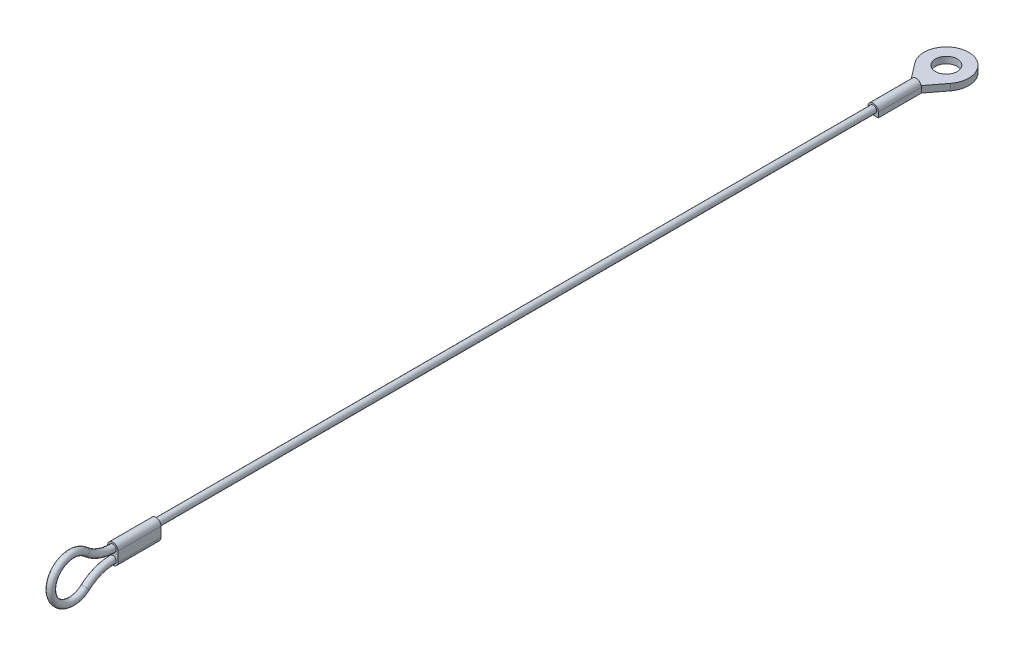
ISO-10303-21;
HEADER;
FILE_DESCRIPTION(('STEP AP214'),'2;1');
FILE_NAME('part.step','',(''),(''),'','','');
FILE_SCHEMA(('AUTOMOTIVE_DESIGN { 1 0 10303 214 1 1 1 1 }'));
ENDSEC;
DATA;
#1=APPLICATION_CONTEXT('core data for automotive mechanical design processes');
#2=APPLICATION_PROTOCOL_DEFINITION('international standard','automotive_design',2000,#1);
#3=PRODUCT_CONTEXT('',#1,'mechanical');
#4=PRODUCT('Part','Part','',(#3));
#5=PRODUCT_RELATED_PRODUCT_CATEGORY('part','',(#4));
#6=PRODUCT_DEFINITION_FORMATION('','',#4);
#7=PRODUCT_DEFINITION_CONTEXT('part definition',#1,'design');
#8=PRODUCT_DEFINITION('design','',#6,#7);
#9=PRODUCT_DEFINITION_SHAPE('','',#8);
#10=(LENGTH_UNIT() NAMED_UNIT(*) SI_UNIT(.MILLI.,.METRE.));
#11=(NAMED_UNIT(*) PLANE_ANGLE_UNIT() SI_UNIT($,.RADIAN.));
#12=(NAMED_UNIT(*) SI_UNIT($,.STERADIAN.) SOLID_ANGLE_UNIT());
#13=UNCERTAINTY_MEASURE_WITH_UNIT(LENGTH_MEASURE(1.E-05),#10,'distance_accuracy_value','');
#14=(GEOMETRIC_REPRESENTATION_CONTEXT(3) GLOBAL_UNCERTAINTY_ASSIGNED_CONTEXT((#13)) GLOBAL_UNIT_ASSIGNED_CONTEXT((#10,
#11,#12)) REPRESENTATION_CONTEXT('',''));
#15=CARTESIAN_POINT('',(0.,0.,0.));
#16=DIRECTION('',(0.,0.,1.));
#17=DIRECTION('',(1.,0.,0.));
#18=AXIS2_PLACEMENT_3D('',#15,#16,#17);
#19=CARTESIAN_POINT('',(0.,0.,-10.));
#20=DIRECTION('',(0.,0.,-1.));
#21=DIRECTION('',(-1.,0.,0.));
#22=AXIS2_PLACEMENT_3D('',#19,#20,#21);
#23=PLANE('',#22);
#24=CARTESIAN_POINT('',(0.,0.,-10.));
#25=DIRECTION('',(0.,0.,-1.));
#26=DIRECTION('',(-1.,0.,0.));
#27=AXIS2_PLACEMENT_3D('',#24,#25,#26);
#28=CIRCLE('',#27,1.195);
#29=CARTESIAN_POINT('',(-1.1499565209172,0.325,-10.));
#30=VERTEX_POINT('',#29);
#31=CARTESIAN_POINT('',(1.1499565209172,0.325,-10.));
#32=VERTEX_POINT('',#31);
#33=EDGE_CURVE('E201',#30,#32,#28,.T.);
#34=ORIENTED_EDGE('',*,*,#33,.T.);
#35=DIRECTION('',(-1.,0.,0.));
#36=VECTOR('',#35,1.);
#37=CARTESIAN_POINT('',(-1.195,0.325,-10.));
#38=LINE('',#37,#36);
#39=EDGE_CURVE('E11',#32,#30,#38,.T.);
#40=ORIENTED_EDGE('',*,*,#39,.T.);
#41=EDGE_LOOP('',(#34,#40));
#42=FACE_BOUND('',#41,.T.);
#43=ADVANCED_FACE('F39',(#42),#23,.T.);
#44=CARTESIAN_POINT('',(0.,0.,176.6));
#45=DIRECTION('',(0.,0.,-1.));
#46=DIRECTION('',(-1.,0.,0.));
#47=AXIS2_PLACEMENT_3D('',#44,#45,#46);
#48=CYLINDRICAL_SURFACE('',#47,0.795);
#49=CARTESIAN_POINT('',(0.,0.,166.6));
#50=DIRECTION('',(0.,0.,-1.));
#51=DIRECTION('',(0.,1.,0.));
#52=AXIS2_PLACEMENT_3D('',#49,#50,#51);
#53=CIRCLE('',#52,0.795);
#54=CARTESIAN_POINT('',(0.,0.795,166.6));
#55=VERTEX_POINT('',#54);
#56=EDGE_CURVE('E43',#55,#55,#53,.T.);
#57=ORIENTED_EDGE('',*,*,#56,.T.);
#58=EDGE_LOOP('',(#57));
#59=FACE_BOUND('',#58,.T.);
#60=CARTESIAN_POINT('',(0.,0.,0.));
#61=DIRECTION('',(0.,0.,1.));
#62=DIRECTION('',(1.,0.,0.));
#63=AXIS2_PLACEMENT_3D('',#60,#61,#62);
#64=CIRCLE('',#63,0.795);
#65=CARTESIAN_POINT('',(0.795,0.,0.));
#66=VERTEX_POINT('',#65);
#67=EDGE_CURVE('E236',#66,#66,#64,.T.);
#68=ORIENTED_EDGE('',*,*,#67,.T.);
#69=EDGE_LOOP('',(#68));
#70=FACE_BOUND('',#69,.T.);
#71=ADVANCED_FACE('F41',(#59,#70),#48,.T.);
#72=CARTESIAN_POINT('',(0.,2.40837442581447E-13,166.6));
#73=DIRECTION('',(0.,0.,1.));
#74=DIRECTION('',(0.,-1.,0.));
#75=AXIS2_PLACEMENT_3D('',#72,#73,#74);
#76=CYLINDRICAL_SURFACE('',#75,1.195);
#77=CARTESIAN_POINT('',(0.,2.5529347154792E-13,176.6));
#78=DIRECTION('',(0.,0.,-1.));
#79=DIRECTION('',(0.,1.,0.));
#80=AXIS2_PLACEMENT_3D('',#77,#78,#79);
#81=CIRCLE('',#80,1.195);
#82=CARTESIAN_POINT('',(-1.195,2.55439816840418E-13,176.6));
#83=VERTEX_POINT('',#82);
#84=CARTESIAN_POINT('',(1.195,2.55147126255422E-13,176.6));
#85=VERTEX_POINT('',#84);
#86=EDGE_CURVE('E248',#83,#85,#81,.T.);
#87=ORIENTED_EDGE('',*,*,#86,.T.);
#88=DIRECTION('',(0.,0.,1.));
#89=VECTOR('',#88,1.);
#90=CARTESIAN_POINT('',(1.195,2.40691097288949E-13,166.6));
#91=LINE('',#90,#89);
#92=CARTESIAN_POINT('',(1.195,2.40691097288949E-13,166.6));
#93=VERTEX_POINT('',#92);
#94=EDGE_CURVE('E268',#93,#85,#91,.T.);
#95=ORIENTED_EDGE('',*,*,#94,.F.);
#96=CARTESIAN_POINT('',(0.,2.40837442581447E-13,166.6));
#97=DIRECTION('',(0.,0.,-1.));
#98=DIRECTION('',(0.,1.,0.));
#99=AXIS2_PLACEMENT_3D('',#96,#97,#98);
#100=CIRCLE('',#99,1.195);
#101=CARTESIAN_POINT('',(-1.195,2.40983787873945E-13,166.6));
#102=VERTEX_POINT('',#101);
#103=EDGE_CURVE('E237',#102,#93,#100,.T.);
#104=ORIENTED_EDGE('',*,*,#103,.F.);
#105=DIRECTION('',(0.,0.,1.));
#106=VECTOR('',#105,1.);
#107=CARTESIAN_POINT('',(-1.195,2.40983787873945E-13,166.6));
#108=LINE('',#107,#106);
#109=EDGE_CURVE('E247',#102,#83,#108,.T.);
#110=ORIENTED_EDGE('',*,*,#109,.T.);
#111=EDGE_LOOP('',(#87,#95,#104,#110));
#112=FACE_BOUND('',#111,.T.);
#113=ADVANCED_FACE('F330',(#112),#76,.T.);
#114=CARTESIAN_POINT('',(1.195,2.40691097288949E-13,166.6));
#115=DIRECTION('',(-1.,0.,0.));
#116=DIRECTION('',(0.,-1.,0.));
#117=AXIS2_PLACEMENT_3D('',#114,#115,#116);
#118=PLANE('',#117);
#119=DIRECTION('',(0.,-1.,0.));
#120=VECTOR('',#119,1.);
#121=CARTESIAN_POINT('',(1.195,2.55147126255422E-13,176.6));
#122=LINE('',#121,#120);
#123=CARTESIAN_POINT('',(1.195,-2.26625258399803,176.6));
#124=VERTEX_POINT('',#123);
#125=EDGE_CURVE('E252',#85,#124,#122,.T.);
#126=ORIENTED_EDGE('',*,*,#125,.T.);
#127=DIRECTION('',(0.,0.,1.));
#128=VECTOR('',#127,1.);
#129=CARTESIAN_POINT('',(1.195,-2.26625258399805,166.6));
#130=LINE('',#129,#128);
#131=CARTESIAN_POINT('',(1.195,-2.26625258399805,166.6));
#132=VERTEX_POINT('',#131);
#133=EDGE_CURVE('E264',#132,#124,#130,.T.);
#134=ORIENTED_EDGE('',*,*,#133,.F.);
#135=DIRECTION('',(0.,-1.,0.));
#136=VECTOR('',#135,1.);
#137=CARTESIAN_POINT('',(1.195,2.40691097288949E-13,166.6));
#138=LINE('',#137,#136);
#139=EDGE_CURVE('E96',#93,#132,#138,.T.);
#140=ORIENTED_EDGE('',*,*,#139,.F.);
#141=ORIENTED_EDGE('',*,*,#94,.T.);
#142=EDGE_LOOP('',(#126,#134,#140,#141));
#143=FACE_BOUND('',#142,.T.);
#144=ADVANCED_FACE('F359',(#143),#118,.F.);
#145=CARTESIAN_POINT('',(0.,-2.26625258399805,166.6));
#146=DIRECTION('',(0.,0.,1.));
#147=DIRECTION('',(0.,-1.,0.));
#148=AXIS2_PLACEMENT_3D('',#145,#146,#147);
#149=CYLINDRICAL_SURFACE('',#148,1.195);
#150=CARTESIAN_POINT('',(0.,-2.26625258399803,176.6));
#151=DIRECTION('',(0.,0.,-1.));
#152=DIRECTION('',(0.,1.,0.));
#153=AXIS2_PLACEMENT_3D('',#150,#151,#152);
#154=CIRCLE('',#153,1.195);
#155=CARTESIAN_POINT('',(-1.195,-2.26625258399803,176.6));
#156=VERTEX_POINT('',#155);
#157=EDGE_CURVE('E255',#124,#156,#154,.T.);
#158=ORIENTED_EDGE('',*,*,#157,.T.);
#159=DIRECTION('',(0.,0.,1.));
#160=VECTOR('',#159,1.);
#161=CARTESIAN_POINT('',(-1.195,-2.26625258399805,166.6));
#162=LINE('',#161,#160);
#163=CARTESIAN_POINT('',(-1.195,-2.26625258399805,166.6));
#164=VERTEX_POINT('',#163);
#165=EDGE_CURVE('E261',#164,#156,#162,.T.);
#166=ORIENTED_EDGE('',*,*,#165,.F.);
#167=CARTESIAN_POINT('',(0.,-2.26625258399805,166.6));
#168=DIRECTION('',(0.,0.,-1.));
#169=DIRECTION('',(0.,1.,0.));
#170=AXIS2_PLACEMENT_3D('',#167,#168,#169);
#171=CIRCLE('',#170,1.195);
#172=EDGE_CURVE('E242',#132,#164,#171,.T.);
#173=ORIENTED_EDGE('',*,*,#172,.F.);
#174=ORIENTED_EDGE('',*,*,#133,.T.);
#175=EDGE_LOOP('',(#158,#166,#173,#174));
#176=FACE_BOUND('',#175,.T.);
#177=ADVANCED_FACE('F356',(#176),#149,.T.);
#178=CARTESIAN_POINT('',(-1.195,2.40983787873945E-13,166.6));
#179=DIRECTION('',(1.,0.,0.));
#180=DIRECTION('',(0.,0.,-1.));
#181=AXIS2_PLACEMENT_3D('',#178,#179,#180);
#182=PLANE('',#181);
#183=DIRECTION('',(0.,1.,0.));
#184=VECTOR('',#183,1.);
#185=CARTESIAN_POINT('',(-1.195,2.55439816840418E-13,176.6));
#186=LINE('',#185,#184);
#187=EDGE_CURVE('E88',#156,#83,#186,.T.);
#188=ORIENTED_EDGE('',*,*,#187,.T.);
#189=ORIENTED_EDGE('',*,*,#109,.F.);
#190=DIRECTION('',(0.,1.,0.));
#191=VECTOR('',#190,1.);
#192=CARTESIAN_POINT('',(-1.195,2.40983787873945E-13,166.6));
#193=LINE('',#192,#191);
#194=EDGE_CURVE('E67',#164,#102,#193,.T.);
#195=ORIENTED_EDGE('',*,*,#194,.F.);
#196=ORIENTED_EDGE('',*,*,#165,.T.);
#197=EDGE_LOOP('',(#188,#189,#195,#196));
#198=FACE_BOUND('',#197,.T.);
#199=ADVANCED_FACE('F348',(#198),#182,.F.);
#200=CARTESIAN_POINT('',(0.,2.40837442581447E-13,166.6));
#201=DIRECTION('',(0.,0.,-1.));
#202=DIRECTION('',(0.,1.,0.));
#203=AXIS2_PLACEMENT_3D('',#200,#201,#202);
#204=PLANE('',#203);
#205=ORIENTED_EDGE('',*,*,#56,.F.);
#206=EDGE_LOOP('',(#205));
#207=FACE_BOUND('',#206,.T.);
#208=ORIENTED_EDGE('',*,*,#103,.T.);
#209=ORIENTED_EDGE('',*,*,#139,.T.);
#210=ORIENTED_EDGE('',*,*,#172,.T.);
#211=ORIENTED_EDGE('',*,*,#194,.T.);
#212=EDGE_LOOP('',(#208,#209,#210,#211));
#213=FACE_BOUND('',#212,.T.);
#214=ADVANCED_FACE('F344',(#207,#213),#204,.T.);
#215=CARTESIAN_POINT('',(0.,2.5529347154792E-13,176.6));
#216=DIRECTION('',(0.,0.,-1.));
#217=DIRECTION('',(0.,1.,0.));
#218=AXIS2_PLACEMENT_3D('',#215,#216,#217);
#219=PLANE('',#218);
#220=CARTESIAN_POINT('',(0.,-2.26625258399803,176.6));
#221=DIRECTION('',(0.,0.,-1.));
#222=DIRECTION('',(1.,0.,0.));
#223=AXIS2_PLACEMENT_3D('',#220,#221,#222);
#224=CIRCLE('',#223,0.795);
#225=CARTESIAN_POINT('',(0.,-1.47125258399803,176.6));
#226=VERTEX_POINT('',#225);
#227=EDGE_CURVE('E275',#226,#226,#224,.T.);
#228=ORIENTED_EDGE('',*,*,#227,.T.);
#229=EDGE_LOOP('',(#228));
#230=FACE_BOUND('',#229,.T.);
#231=CARTESIAN_POINT('',(0.,0.,176.6));
#232=DIRECTION('',(0.,0.,-1.));
#233=DIRECTION('',(0.,1.,0.));
#234=AXIS2_PLACEMENT_3D('',#231,#232,#233);
#235=CIRCLE('',#234,0.795);
#236=CARTESIAN_POINT('',(0.,-0.795000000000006,176.6));
#237=VERTEX_POINT('',#236);
#238=EDGE_CURVE('E271',#237,#237,#235,.T.);
#239=ORIENTED_EDGE('',*,*,#238,.T.);
#240=EDGE_LOOP('',(#239));
#241=FACE_BOUND('',#240,.T.);
#242=ORIENTED_EDGE('',*,*,#86,.F.);
#243=ORIENTED_EDGE('',*,*,#187,.F.);
#244=ORIENTED_EDGE('',*,*,#157,.F.);
#245=ORIENTED_EDGE('',*,*,#125,.F.);
#246=EDGE_LOOP('',(#242,#243,#244,#245));
#247=FACE_BOUND('',#246,.T.);
#248=ADVANCED_FACE('F347',(#230,#241,#247),#219,.F.);
#249=CARTESIAN_POINT('',(0.,-11.866252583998,176.6));
#250=DIRECTION('',(1.,0.,0.));
#251=DIRECTION('',(0.,0.,-1.));
#252=AXIS2_PLACEMENT_3D('',#249,#250,#251);
#253=TOROIDAL_SURFACE('',#252,9.59999999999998,0.795);
#254=CARTESIAN_POINT('',(0.,-4.71083505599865,183.));
#255=DIRECTION('',(0.,0.666666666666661,-0.745355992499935));
#256=DIRECTION('',(1.,0.,0.));
#257=AXIS2_PLACEMENT_3D('',#254,#255,#256);
#258=CIRCLE('',#257,0.795);
#259=CARTESIAN_POINT('',(0.,-4.1182770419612,183.53));
#260=VERTEX_POINT('',#259);
#261=EDGE_CURVE('E279',#260,#260,#258,.T.);
#262=CARTESIAN_POINT('',(0.,-11.866252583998,176.6));
#263=DIRECTION('',(1.,0.,0.));
#264=DIRECTION('',(0.,0.,-1.));
#265=AXIS2_PLACEMENT_3D('',#262,#263,#264);
#266=CIRCLE('',#265,10.395);
#267=EDGE_CURVE('',#226,#260,#266,.T.);
#268=ORIENTED_EDGE('',*,*,#227,.F.);
#269=ORIENTED_EDGE('',*,*,#261,.T.);
#270=ORIENTED_EDGE('',*,*,#267,.T.);
#271=ORIENTED_EDGE('',*,*,#267,.F.);
#272=EDGE_LOOP('',(#268,#270,#269,#271));
#273=FACE_BOUND('',#272,.T.);
#274=ADVANCED_FACE('F352',(#273),#253,.T.);
#275=CARTESIAN_POINT('',(0.,-1.13312629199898,186.2));
#276=DIRECTION('',(-1.,0.,0.));
#277=DIRECTION('',(0.,0.,1.));
#278=AXIS2_PLACEMENT_3D('',#275,#276,#277);
#279=TOROIDAL_SURFACE('',#278,4.79999999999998,0.795);
#280=CARTESIAN_POINT('',(0.,2.44458247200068,183.));
#281=DIRECTION('',(0.,0.666666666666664,0.745355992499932));
#282=DIRECTION('',(1.,0.,0.));
#283=AXIS2_PLACEMENT_3D('',#280,#281,#282);
#284=CIRCLE('',#283,0.795);
#285=CARTESIAN_POINT('',(0.,1.85202445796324,183.53));
#286=VERTEX_POINT('',#285);
#287=EDGE_CURVE('E49',#286,#286,#284,.T.);
#288=ORIENTED_EDGE('',*,*,#287,.T.);
#289=EDGE_LOOP('',(#288));
#290=FACE_BOUND('',#289,.T.);
#291=ORIENTED_EDGE('',*,*,#261,.F.);
#292=EDGE_LOOP('',(#291));
#293=FACE_BOUND('',#292,.T.);
#294=ADVANCED_FACE('F368',(#290,#293),#279,.T.);
#295=CARTESIAN_POINT('',(0.,9.6,176.6));
#296=DIRECTION('',(1.,0.,0.));
#297=DIRECTION('',(0.,0.,-1.));
#298=AXIS2_PLACEMENT_3D('',#295,#296,#297);
#299=TOROIDAL_SURFACE('',#298,9.6,0.795);
#300=CARTESIAN_POINT('',(0.,9.6,176.6));
#301=DIRECTION('',(1.,0.,0.));
#302=DIRECTION('',(0.,0.,-1.));
#303=AXIS2_PLACEMENT_3D('',#300,#301,#302);
#304=CIRCLE('',#303,10.395);
#305=EDGE_CURVE('',#286,#237,#304,.T.);
#306=ORIENTED_EDGE('',*,*,#287,.F.);
#307=ORIENTED_EDGE('',*,*,#238,.F.);
#308=ORIENTED_EDGE('',*,*,#305,.T.);
#309=ORIENTED_EDGE('',*,*,#305,.F.);
#310=EDGE_LOOP('',(#306,#308,#307,#309));
#311=FACE_BOUND('',#310,.T.);
#312=ADVANCED_FACE('F343',(#311),#299,.T.);
#313=CARTESIAN_POINT('',(0.,0.,-10.));
#314=DIRECTION('',(0.,0.,1.));
#315=DIRECTION('',(1.,0.,0.));
#316=AXIS2_PLACEMENT_3D('',#313,#314,#315);
#317=CYLINDRICAL_SURFACE('',#316,1.195);
#318=CARTESIAN_POINT('',(0.,0.,0.));
#319=DIRECTION('',(0.,0.,-1.));
#320=DIRECTION('',(-1.,0.,0.));
#321=AXIS2_PLACEMENT_3D('',#318,#319,#320);
#322=CIRCLE('',#321,1.195);
#323=CARTESIAN_POINT('',(-1.195,0.,0.));
#324=VERTEX_POINT('',#323);
#325=CARTESIAN_POINT('',(1.195,0.,0.));
#326=VERTEX_POINT('',#325);
#327=EDGE_CURVE('E190',#324,#326,#322,.T.);
#328=ORIENTED_EDGE('',*,*,#327,.T.);
#329=DIRECTION('',(0.,0.,1.));
#330=VECTOR('',#329,1.);
#331=CARTESIAN_POINT('',(1.195,0.,-10.));
#332=LINE('',#331,#330);
#333=CARTESIAN_POINT('',(1.195,0.,-10.));
#334=VERTEX_POINT('',#333);
#335=EDGE_CURVE('E232',#334,#326,#332,.T.);
#336=ORIENTED_EDGE('',*,*,#335,.F.);
#337=EDGE_CURVE('E202',#32,#334,#28,.T.);
#338=ORIENTED_EDGE('',*,*,#337,.F.);
#339=ORIENTED_EDGE('',*,*,#33,.F.);
#340=CARTESIAN_POINT('',(-1.195,0.,-10.));
#341=VERTEX_POINT('',#340);
#342=EDGE_CURVE('E197',#341,#30,#28,.T.);
#343=ORIENTED_EDGE('',*,*,#342,.F.);
#344=DIRECTION('',(0.,0.,1.));
#345=VECTOR('',#344,1.);
#346=CARTESIAN_POINT('',(-1.195,0.,-10.));
#347=LINE('',#346,#345);
#348=EDGE_CURVE('E208',#341,#324,#347,.T.);
#349=ORIENTED_EDGE('',*,*,#348,.T.);
#350=EDGE_LOOP('',(#328,#336,#338,#339,#343,#349));
#351=FACE_BOUND('',#350,.T.);
#352=ADVANCED_FACE('F300',(#351),#317,.T.);
#353=CARTESIAN_POINT('',(1.195,0.,-10.));
#354=DIRECTION('',(-1.,0.,0.));
#355=DIRECTION('',(0.,-1.,0.));
#356=AXIS2_PLACEMENT_3D('',#353,#354,#355);
#357=PLANE('',#356);
#358=DIRECTION('',(0.,-1.,0.));
#359=VECTOR('',#358,1.);
#360=CARTESIAN_POINT('',(1.195,0.,0.));
#361=LINE('',#360,#359);
#362=CARTESIAN_POINT('',(1.195,-1.195,0.));
#363=VERTEX_POINT('',#362);
#364=EDGE_CURVE('E212',#326,#363,#361,.T.);
#365=ORIENTED_EDGE('',*,*,#364,.T.);
#366=DIRECTION('',(0.,0.,1.));
#367=VECTOR('',#366,1.);
#368=CARTESIAN_POINT('',(1.195,-1.195,-10.));
#369=LINE('',#368,#367);
#370=CARTESIAN_POINT('',(1.195,-1.195,-10.));
#371=VERTEX_POINT('',#370);
#372=EDGE_CURVE('E228',#371,#363,#369,.T.);
#373=ORIENTED_EDGE('',*,*,#372,.F.);
#374=DIRECTION('',(0.,-1.,0.));
#375=VECTOR('',#374,1.);
#376=CARTESIAN_POINT('',(1.195,0.,-10.));
#377=LINE('',#376,#375);
#378=EDGE_CURVE('E200',#334,#371,#377,.T.);
#379=ORIENTED_EDGE('',*,*,#378,.F.);
#380=ORIENTED_EDGE('',*,*,#335,.T.);
#381=EDGE_LOOP('',(#365,#373,#379,#380));
#382=FACE_BOUND('',#381,.T.);
#383=ADVANCED_FACE('F313',(#382),#357,.F.);
#384=CARTESIAN_POINT('',(0.,-1.195,-10.));
#385=DIRECTION('',(0.,1.,0.));
#386=DIRECTION('',(0.,0.,1.));
#387=AXIS2_PLACEMENT_3D('',#384,#385,#386);
#388=PLANE('',#387);
#389=DIRECTION('',(-1.,0.,0.));
#390=VECTOR('',#389,1.);
#391=CARTESIAN_POINT('',(0.,-1.195,0.));
#392=LINE('',#391,#390);
#393=CARTESIAN_POINT('',(-1.195,-1.195,0.));
#394=VERTEX_POINT('',#393);
#395=EDGE_CURVE('E215',#363,#394,#392,.T.);
#396=ORIENTED_EDGE('',*,*,#395,.T.);
#397=DIRECTION('',(0.,0.,1.));
#398=VECTOR('',#397,1.);
#399=CARTESIAN_POINT('',(-1.195,-1.195,-10.));
#400=LINE('',#399,#398);
#401=CARTESIAN_POINT('',(-1.195,-1.195,-10.));
#402=VERTEX_POINT('',#401);
#403=EDGE_CURVE('E224',#402,#394,#400,.T.);
#404=ORIENTED_EDGE('',*,*,#403,.F.);
#405=DIRECTION('',(-0.608040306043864,0.,-0.793906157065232));
#406=VECTOR('',#405,1.);
#407=CARTESIAN_POINT('',(-4.13228154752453,-1.195,-13.8351502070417));
#408=LINE('',#407,#406);
#409=CARTESIAN_POINT('',(-4.13228154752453,-1.195,-13.8351502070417));
#410=VERTEX_POINT('',#409);
#411=EDGE_CURVE('E182',#402,#410,#408,.T.);
#412=ORIENTED_EDGE('',*,*,#411,.T.);
#413=CARTESIAN_POINT('',(0.,-1.195,-17.));
#414=DIRECTION('',(0.,-1.,0.));
#415=DIRECTION('',(0.,0.,1.));
#416=AXIS2_PLACEMENT_3D('',#413,#414,#415);
#417=CIRCLE('',#416,5.205);
#418=CARTESIAN_POINT('',(4.13228154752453,-1.195,-13.8351502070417));
#419=VERTEX_POINT('',#418);
#420=EDGE_CURVE('E147',#410,#419,#417,.T.);
#421=ORIENTED_EDGE('',*,*,#420,.T.);
#422=DIRECTION('',(-0.608040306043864,0.,0.793906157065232));
#423=VECTOR('',#422,1.);
#424=CARTESIAN_POINT('',(1.195,-1.195,-10.));
#425=LINE('',#424,#423);
#426=EDGE_CURVE('E167',#419,#371,#425,.T.);
#427=ORIENTED_EDGE('',*,*,#426,.T.);
#428=ORIENTED_EDGE('',*,*,#372,.T.);
#429=EDGE_LOOP('',(#396,#404,#412,#421,#427,#428));
#430=FACE_BOUND('',#429,.T.);
#431=CARTESIAN_POINT('',(0.,-1.195,-17.));
#432=DIRECTION('',(0.,-1.,0.));
#433=DIRECTION('',(0.,0.,-1.));
#434=AXIS2_PLACEMENT_3D('',#431,#432,#433);
#435=CIRCLE('',#434,2.54);
#436=CARTESIAN_POINT('',(0.,-1.195,-19.54));
#437=VERTEX_POINT('',#436);
#438=EDGE_CURVE('E175',#437,#437,#435,.T.);
#439=ORIENTED_EDGE('',*,*,#438,.F.);
#440=EDGE_LOOP('',(#439));
#441=FACE_BOUND('',#440,.T.);
#442=ADVANCED_FACE('F309',(#430,#441),#388,.F.);
#443=CARTESIAN_POINT('',(-1.195,-1.195,-10.));
#444=DIRECTION('',(1.,0.,0.));
#445=DIRECTION('',(0.,1.,0.));
#446=AXIS2_PLACEMENT_3D('',#443,#444,#445);
#447=PLANE('',#446);
#448=DIRECTION('',(0.,1.,0.));
#449=VECTOR('',#448,1.);
#450=CARTESIAN_POINT('',(-1.195,-1.195,0.));
#451=LINE('',#450,#449);
#452=EDGE_CURVE('E218',#394,#324,#451,.T.);
#453=ORIENTED_EDGE('',*,*,#452,.T.);
#454=ORIENTED_EDGE('',*,*,#348,.F.);
#455=DIRECTION('',(0.,1.,0.));
#456=VECTOR('',#455,1.);
#457=CARTESIAN_POINT('',(-1.195,-1.195,-10.));
#458=LINE('',#457,#456);
#459=EDGE_CURVE('E205',#402,#341,#458,.T.);
#460=ORIENTED_EDGE('',*,*,#459,.F.);
#461=ORIENTED_EDGE('',*,*,#403,.T.);
#462=EDGE_LOOP('',(#453,#454,#460,#461));
#463=FACE_BOUND('',#462,.T.);
#464=ADVANCED_FACE('F294',(#463),#447,.F.);
#465=CARTESIAN_POINT('',(0.,0.,0.));
#466=DIRECTION('',(0.,0.,-1.));
#467=DIRECTION('',(-1.,0.,0.));
#468=AXIS2_PLACEMENT_3D('',#465,#466,#467);
#469=PLANE('',#468);
#470=ORIENTED_EDGE('',*,*,#67,.F.);
#471=EDGE_LOOP('',(#470));
#472=FACE_BOUND('',#471,.T.);
#473=ORIENTED_EDGE('',*,*,#327,.F.);
#474=ORIENTED_EDGE('',*,*,#452,.F.);
#475=ORIENTED_EDGE('',*,*,#395,.F.);
#476=ORIENTED_EDGE('',*,*,#364,.F.);
#477=EDGE_LOOP('',(#473,#474,#475,#476));
#478=FACE_BOUND('',#477,.T.);
#479=ADVANCED_FACE('F290',(#472,#478),#469,.F.);
#480=CARTESIAN_POINT('',(-1.195,0.325,-10.));
#481=DIRECTION('',(0.,0.,1.));
#482=DIRECTION('',(1.,0.,0.));
#483=AXIS2_PLACEMENT_3D('',#480,#481,#482);
#484=PLANE('',#483);
#485=DIRECTION('',(0.,-1.,0.));
#486=VECTOR('',#485,1.);
#487=CARTESIAN_POINT('',(-1.195,0.325,-10.));
#488=LINE('',#487,#486);
#489=CARTESIAN_POINT('',(-1.195,0.325,-10.));
#490=VERTEX_POINT('',#489);
#491=EDGE_CURVE('E165',#490,#341,#488,.T.);
#492=ORIENTED_EDGE('',*,*,#491,.T.);
#493=ORIENTED_EDGE('',*,*,#342,.T.);
#494=EDGE_CURVE('E52',#30,#490,#38,.T.);
#495=ORIENTED_EDGE('',*,*,#494,.T.);
#496=EDGE_LOOP('',(#492,#493,#495));
#497=FACE_BOUND('',#496,.T.);
#498=ADVANCED_FACE('F293',(#497),#484,.T.);
#499=CARTESIAN_POINT('',(-4.13228154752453,0.325,-13.8351502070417));
#500=DIRECTION('',(-0.793906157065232,0.,0.608040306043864));
#501=DIRECTION('',(0.608040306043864,0.,0.793906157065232));
#502=AXIS2_PLACEMENT_3D('',#499,#500,#501);
#503=PLANE('',#502);
#504=ORIENTED_EDGE('',*,*,#411,.F.);
#505=ORIENTED_EDGE('',*,*,#459,.T.);
#506=ORIENTED_EDGE('',*,*,#491,.F.);
#507=DIRECTION('',(-0.608040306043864,0.,-0.793906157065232));
#508=VECTOR('',#507,1.);
#509=CARTESIAN_POINT('',(-4.13228154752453,0.325,-13.8351502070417));
#510=LINE('',#509,#508);
#511=CARTESIAN_POINT('',(-4.13228154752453,0.325,-13.8351502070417));
#512=VERTEX_POINT('',#511);
#513=EDGE_CURVE('E156',#490,#512,#510,.T.);
#514=ORIENTED_EDGE('',*,*,#513,.T.);
#515=DIRECTION('',(0.,-1.,0.));
#516=VECTOR('',#515,1.);
#517=CARTESIAN_POINT('',(-4.13228154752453,0.325,-13.8351502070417));
#518=LINE('',#517,#516);
#519=EDGE_CURVE('E142',#512,#410,#518,.T.);
#520=ORIENTED_EDGE('',*,*,#519,.T.);
#521=EDGE_LOOP('',(#504,#505,#506,#514,#520));
#522=FACE_BOUND('',#521,.T.);
#523=ADVANCED_FACE('F163',(#522),#503,.T.);
#524=CARTESIAN_POINT('',(1.195,0.325,-10.));
#525=VERTEX_POINT('',#524);
#526=EDGE_CURVE('E51',#525,#32,#38,.T.);
#527=ORIENTED_EDGE('',*,*,#526,.T.);
#528=ORIENTED_EDGE('',*,*,#337,.T.);
#529=DIRECTION('',(0.,-1.,0.));
#530=VECTOR('',#529,1.);
#531=CARTESIAN_POINT('',(1.195,0.325,-10.));
#532=LINE('',#531,#530);
#533=EDGE_CURVE('E191',#525,#334,#532,.T.);
#534=ORIENTED_EDGE('',*,*,#533,.F.);
#535=EDGE_LOOP('',(#527,#528,#534));
#536=FACE_BOUND('',#535,.T.);
#537=ADVANCED_FACE('F319',(#536),#484,.T.);
#538=CARTESIAN_POINT('',(1.195,0.325,-10.));
#539=DIRECTION('',(0.793906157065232,0.,0.608040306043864));
#540=DIRECTION('',(0.608040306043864,0.,-0.793906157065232));
#541=AXIS2_PLACEMENT_3D('',#538,#539,#540);
#542=PLANE('',#541);
#543=ORIENTED_EDGE('',*,*,#426,.F.);
#544=DIRECTION('',(0.,-1.,0.));
#545=VECTOR('',#544,1.);
#546=CARTESIAN_POINT('',(4.13228154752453,0.325,-13.8351502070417));
#547=LINE('',#546,#545);
#548=CARTESIAN_POINT('',(4.13228154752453,0.325,-13.8351502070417));
#549=VERTEX_POINT('',#548);
#550=EDGE_CURVE('E152',#549,#419,#547,.T.);
#551=ORIENTED_EDGE('',*,*,#550,.F.);
#552=DIRECTION('',(-0.608040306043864,0.,0.793906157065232));
#553=VECTOR('',#552,1.);
#554=CARTESIAN_POINT('',(1.195,0.325,-10.));
#555=LINE('',#554,#553);
#556=EDGE_CURVE('E159',#549,#525,#555,.T.);
#557=ORIENTED_EDGE('',*,*,#556,.T.);
#558=ORIENTED_EDGE('',*,*,#533,.T.);
#559=ORIENTED_EDGE('',*,*,#378,.T.);
#560=EDGE_LOOP('',(#543,#551,#557,#558,#559));
#561=FACE_BOUND('',#560,.T.);
#562=ADVANCED_FACE('F317',(#561),#542,.T.);
#563=CARTESIAN_POINT('',(0.,0.325,-17.));
#564=DIRECTION('',(0.,-1.,0.));
#565=DIRECTION('',(0.,0.,-1.));
#566=AXIS2_PLACEMENT_3D('',#563,#564,#565);
#567=CYLINDRICAL_SURFACE('',#566,5.205);
#568=ORIENTED_EDGE('',*,*,#420,.F.);
#569=ORIENTED_EDGE('',*,*,#519,.F.);
#570=CARTESIAN_POINT('',(0.,0.325,-17.));
#571=DIRECTION('',(0.,-1.,0.));
#572=DIRECTION('',(0.,0.,1.));
#573=AXIS2_PLACEMENT_3D('',#570,#571,#572);
#574=CIRCLE('',#573,5.205);
#575=EDGE_CURVE('E145',#512,#549,#574,.T.);
#576=ORIENTED_EDGE('',*,*,#575,.T.);
#577=ORIENTED_EDGE('',*,*,#550,.T.);
#578=EDGE_LOOP('',(#568,#569,#576,#577));
#579=FACE_BOUND('',#578,.T.);
#580=ADVANCED_FACE('F144',(#579),#567,.T.);
#581=CARTESIAN_POINT('',(0.,0.325,-17.));
#582=DIRECTION('',(0.,1.,0.));
#583=DIRECTION('',(0.,0.,1.));
#584=AXIS2_PLACEMENT_3D('',#581,#582,#583);
#585=PLANE('',#584);
#586=CARTESIAN_POINT('',(0.,0.325,-17.));
#587=DIRECTION('',(0.,-1.,0.));
#588=DIRECTION('',(0.,0.,-1.));
#589=AXIS2_PLACEMENT_3D('',#586,#587,#588);
#590=CIRCLE('',#589,2.54);
#591=CARTESIAN_POINT('',(0.,0.325,-19.54));
#592=VERTEX_POINT('',#591);
#593=EDGE_CURVE('E185',#592,#592,#590,.T.);
#594=ORIENTED_EDGE('',*,*,#593,.T.);
#595=EDGE_LOOP('',(#594));
#596=FACE_BOUND('',#595,.T.);
#597=ORIENTED_EDGE('',*,*,#513,.F.);
#598=ORIENTED_EDGE('',*,*,#494,.F.);
#599=ORIENTED_EDGE('',*,*,#39,.F.);
#600=ORIENTED_EDGE('',*,*,#526,.F.);
#601=ORIENTED_EDGE('',*,*,#556,.F.);
#602=ORIENTED_EDGE('',*,*,#575,.F.);
#603=EDGE_LOOP('',(#597,#598,#599,#600,#601,#602));
#604=FACE_BOUND('',#603,.T.);
#605=ADVANCED_FACE('F155',(#596,#604),#585,.T.);
#606=CARTESIAN_POINT('',(0.,0.325,-17.));
#607=DIRECTION('',(0.,-1.,0.));
#608=DIRECTION('',(0.,0.,-1.));
#609=AXIS2_PLACEMENT_3D('',#606,#607,#608);
#610=CYLINDRICAL_SURFACE('',#609,2.54);
#611=ORIENTED_EDGE('',*,*,#593,.F.);
#612=EDGE_LOOP('',(#611));
#613=FACE_BOUND('',#612,.T.);
#614=ORIENTED_EDGE('',*,*,#438,.T.);
#615=EDGE_LOOP('',(#614));
#616=FACE_BOUND('',#615,.T.);
#617=ADVANCED_FACE('F436',(#613,#616),#610,.F.);
#618=CLOSED_SHELL('',(#43,#71,#113,#144,#177,#199,#214,#248,#274,#294,#312,#352,#383,#442,#464,
#479,#498,#523,#537,#562,#580,#605,#617));
#619=MANIFOLD_SOLID_BREP('B2',#618);
#620=ADVANCED_BREP_SHAPE_REPRESENTATION('',(#18,#619),#14);
#621=SHAPE_DEFINITION_REPRESENTATION(#9,#620);
ENDSEC;
END-ISO-10303-21;
